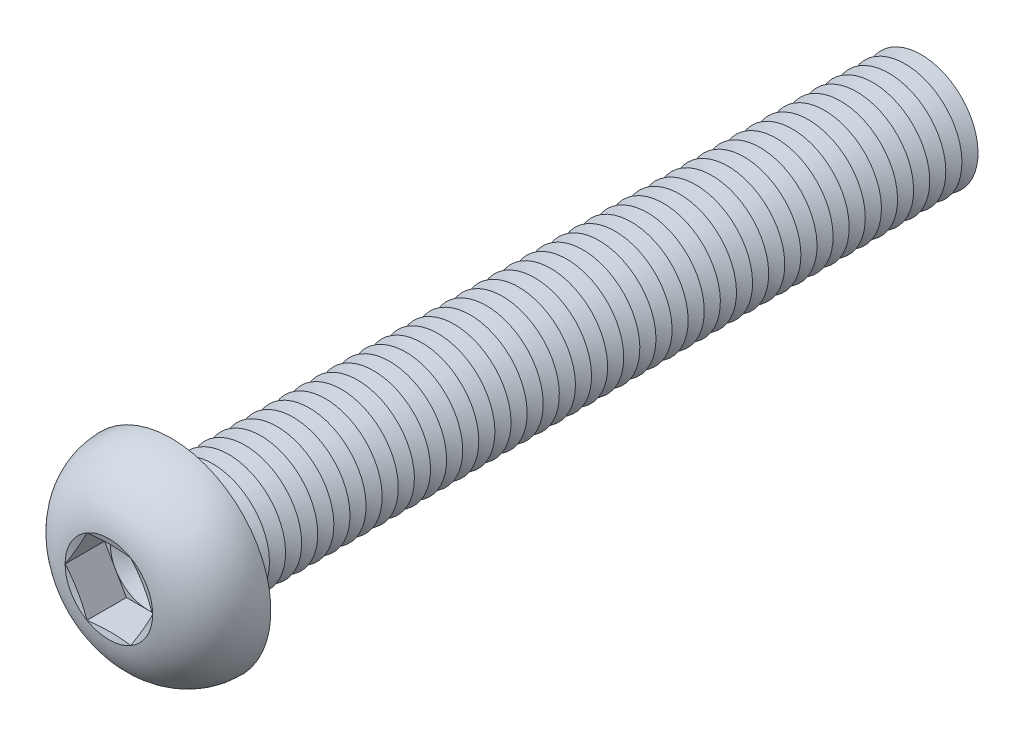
from build123d import *

# Parameters (mm, degrees)
FILLET1_R          = 0.85
LPATTERN1_COUNT    = 47
LPATTERN1_PITCH    = 1.7
CUT_EXTRUDE1_DEPTH = 4.16


with BuildPart() as part:
    # Sketch1 → Revolve1 (revolve)
    with BuildSketch(Plane(origin=(0, 0, 0), x_dir=(0, 0, -1), z_dir=(1, 0, 0))):
        with BuildLine():
            Line((0, 6), (0, 10.5))
            ThreePointArc((0, 10.5), (-4.420082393, 8.816378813), (-6.6, 4.6188))
            Line((-6.6, 4.6188), (-5.981198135, 2.3094))
            Line((-5.981198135, 2.3094), (-6.6, 2.3094))
            Line((-6.6, 2.3094), (-6.6, 0))
            Line((-6.6, 0), (80, 0))
            Line((80, 0), (80, 6))
            Line((80, 6), (0, 6))
        make_face()
    revolve(axis=Axis((0, 0, -80), (0, 0, 1)))

    # Fillet1
    fillet1_edges = [part.edges().sort_by_distance(p)[0] for p in [
        (0, -6, 0),
    ]]
    fillet(fillet1_edges, radius=FILLET1_R)

    # Sketch2 → Cut-Revolve1 (revolve, cut)
    with BuildSketch(Plane(origin=(0, 0, 0), x_dir=(0, 0, -1), z_dir=(1, 0, 0))):
        Polygon((79.15, 6), (80.85, 6), (80, 4.527756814), align=None)
    cut_revolve1 = revolve(axis=Axis((0, 0, -80), (0, 0, -1)), mode=Mode.SUBTRACT)

    # LPattern1: Cut-Revolve1 ×47
    with Locations(*[(0, 0, i * LPATTERN1_PITCH) for i in range(1, LPATTERN1_COUNT)]):
        add(cut_revolve1, mode=Mode.SUBTRACT)

    # Sketch3 → Cut-Extrude1 (cut)
    with BuildSketch(Plane.XY.offset(6.6)):
        Polygon((2.3094, 3.999998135), (-2.3094, 3.999998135), (-4.6188, 0), (-2.3094, -3.999998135), (2.3094, -3.999998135), (4.6188, 0), align=None)
    extrude(amount=-CUT_EXTRUDE1_DEPTH, mode=Mode.SUBTRACT)

    # Cut-Extrude2 cone 1 section (on through the dimple's axis) → Cut-Extrude2 (revolve, cut)
    with BuildSketch(Plane(origin=(0, 0, 2.44), x_dir=(0, -1, 0), z_dir=(1, 0, 0))):
        Polygon((0, 0), (3.999998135, 0), (0, 2.3094), align=None)
    revolve(axis=Axis((0, 0, 2.44), (0, 0, -1)), mode=Mode.SUBTRACT)


solid = part.part
